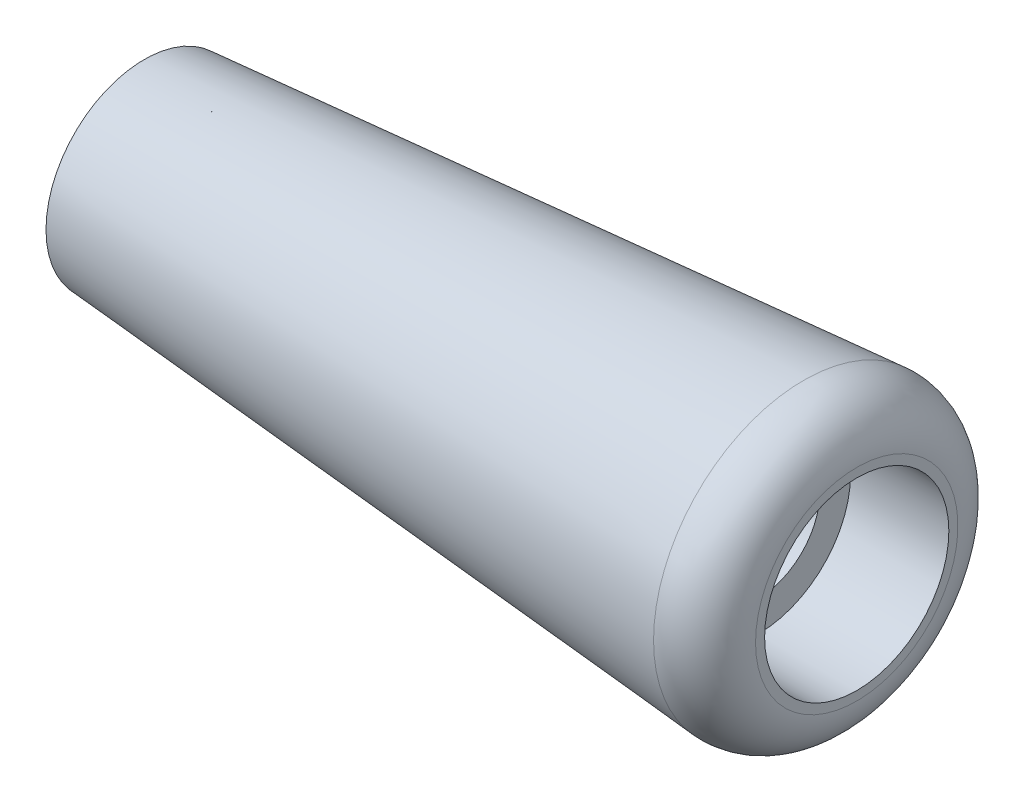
from build123d import *

# Parameters (mm, degrees)
CONG_1_R        = 4
CHANFREIN1_SIZE = 0.5


with BuildPart() as part:
    # Esquisse1 → R_volution2 (revolve)
    with BuildSketch(Plane.XY, mode=Mode.PRIVATE) as r_volution2_sk:
        Polygon((-44.490947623, 5), (-44.490947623, 8), (13.509052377, 12.564698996), (13.509052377, 7.5), (5.509052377, 7.5), (5.509052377, 5), align=None)
    revolve(r_volution2_sk.sketch.rotate(Axis((-59.811625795, 0, 0), (1, 0, 0)), 90), axis=Axis((-59.811625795, 0, 0), (1, 0, 0)))

    # Cong_1
    cong_1_edges = [part.edges().sort_by_distance(p)[0] for p in [
        (13.509052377, 0, -12.564698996),
    ]]
    fillet(cong_1_edges, radius=CONG_1_R)

    # Chanfrein1
    chanfrein1_edges = [part.edges().sort_by_distance(p)[0] for p in [
        (-44.490947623, 0, -5),
    ]]
    chamfer(chanfrein1_edges, length=CHANFREIN1_SIZE)


solid = part.part
